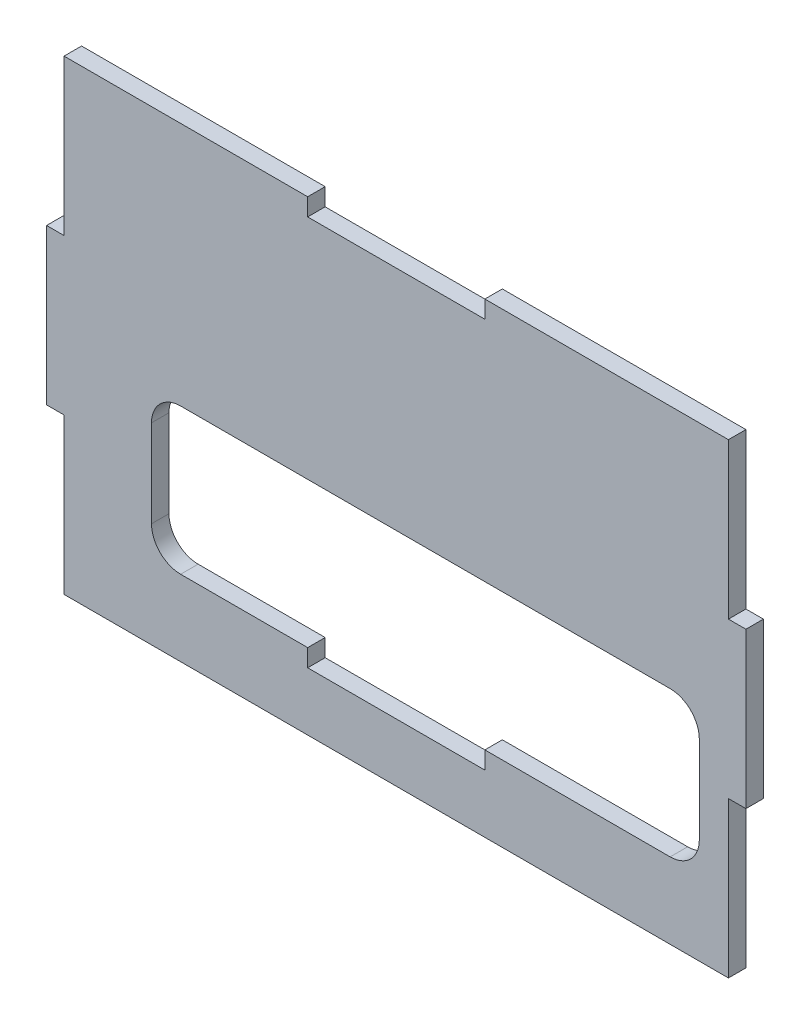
ISO-10303-21;
HEADER;
FILE_DESCRIPTION(('STEP AP214'),'2;1');
FILE_NAME('part.step','',(''),(''),'','','');
FILE_SCHEMA(('AUTOMOTIVE_DESIGN { 1 0 10303 214 1 1 1 1 }'));
ENDSEC;
DATA;
#1=APPLICATION_CONTEXT('core data for automotive mechanical design processes');
#2=APPLICATION_PROTOCOL_DEFINITION('international standard','automotive_design',2000,#1);
#3=PRODUCT_CONTEXT('',#1,'mechanical');
#4=PRODUCT('Part','Part','',(#3));
#5=PRODUCT_RELATED_PRODUCT_CATEGORY('part','',(#4));
#6=PRODUCT_DEFINITION_FORMATION('','',#4);
#7=PRODUCT_DEFINITION_CONTEXT('part definition',#1,'design');
#8=PRODUCT_DEFINITION('design','',#6,#7);
#9=PRODUCT_DEFINITION_SHAPE('','',#8);
#10=(LENGTH_UNIT() NAMED_UNIT(*) SI_UNIT(.MILLI.,.METRE.));
#11=(NAMED_UNIT(*) PLANE_ANGLE_UNIT() SI_UNIT($,.RADIAN.));
#12=(NAMED_UNIT(*) SI_UNIT($,.STERADIAN.) SOLID_ANGLE_UNIT());
#13=UNCERTAINTY_MEASURE_WITH_UNIT(LENGTH_MEASURE(1.E-05),#10,'distance_accuracy_value','');
#14=(GEOMETRIC_REPRESENTATION_CONTEXT(3) GLOBAL_UNCERTAINTY_ASSIGNED_CONTEXT((#13)) GLOBAL_UNIT_ASSIGNED_CONTEXT((#10,
#11,#12)) REPRESENTATION_CONTEXT('',''));
#15=CARTESIAN_POINT('',(0.,0.,0.));
#16=DIRECTION('',(0.,0.,1.));
#17=DIRECTION('',(1.,0.,0.));
#18=AXIS2_PLACEMENT_3D('',#15,#16,#17);
#19=CARTESIAN_POINT('',(0.,0.,3.));
#20=DIRECTION('',(0.,0.,-1.));
#21=DIRECTION('',(-1.,0.,0.));
#22=AXIS2_PLACEMENT_3D('',#19,#20,#21);
#23=PLANE('',#22);
#24=DIRECTION('',(0.,1.,0.));
#25=VECTOR('',#24,1.);
#26=CARTESIAN_POINT('',(52.,-27.,3.));
#27=LINE('',#26,#25);
#28=CARTESIAN_POINT('',(52.,-22.,3.));
#29=VERTEX_POINT('',#28);
#30=CARTESIAN_POINT('',(52.,-7.00000000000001,3.));
#31=VERTEX_POINT('',#30);
#32=EDGE_CURVE('E294',#29,#31,#27,.T.);
#33=ORIENTED_EDGE('',*,*,#32,.F.);
#34=CARTESIAN_POINT('',(47.,-22.,3.));
#35=DIRECTION('',(0.,0.,-1.));
#36=DIRECTION('',(-1.,0.,0.));
#37=AXIS2_PLACEMENT_3D('',#34,#35,#36);
#38=CIRCLE('',#37,5.);
#39=CARTESIAN_POINT('',(47.,-27.,3.));
#40=VERTEX_POINT('',#39);
#41=EDGE_CURVE('E40',#29,#40,#38,.T.);
#42=ORIENTED_EDGE('',*,*,#41,.T.);
#43=DIRECTION('',(1.,0.,0.));
#44=VECTOR('',#43,1.);
#45=CARTESIAN_POINT('',(-42.,-27.,3.));
#46=LINE('',#45,#44);
#47=CARTESIAN_POINT('',(15.2,-27.,3.));
#48=VERTEX_POINT('',#47);
#49=EDGE_CURVE('E291',#48,#40,#46,.T.);
#50=ORIENTED_EDGE('',*,*,#49,.F.);
#51=DIRECTION('',(0.,-1.,0.));
#52=VECTOR('',#51,1.);
#53=CARTESIAN_POINT('',(15.2,0.,3.));
#54=LINE('',#53,#52);
#55=CARTESIAN_POINT('',(15.2,-30.,3.));
#56=VERTEX_POINT('',#55);
#57=EDGE_CURVE('E380',#48,#56,#54,.T.);
#58=ORIENTED_EDGE('',*,*,#57,.T.);
#59=DIRECTION('',(1.,0.,0.));
#60=VECTOR('',#59,1.);
#61=CARTESIAN_POINT('',(0.,-30.,3.));
#62=LINE('',#61,#60);
#63=CARTESIAN_POINT('',(-15.2,-30.,3.));
#64=VERTEX_POINT('',#63);
#65=EDGE_CURVE('E403',#64,#56,#62,.T.);
#66=ORIENTED_EDGE('',*,*,#65,.F.);
#67=DIRECTION('',(0.,-1.,0.));
#68=VECTOR('',#67,1.);
#69=CARTESIAN_POINT('',(-15.2,0.,3.));
#70=LINE('',#69,#68);
#71=CARTESIAN_POINT('',(-15.2,-27.,3.));
#72=VERTEX_POINT('',#71);
#73=EDGE_CURVE('E410',#72,#64,#70,.T.);
#74=ORIENTED_EDGE('',*,*,#73,.F.);
#75=CARTESIAN_POINT('',(-37.,-27.,3.));
#76=VERTEX_POINT('',#75);
#77=EDGE_CURVE('E300',#76,#72,#46,.T.);
#78=ORIENTED_EDGE('',*,*,#77,.F.);
#79=CARTESIAN_POINT('',(-37.,-22.,3.));
#80=DIRECTION('',(0.,0.,-1.));
#81=DIRECTION('',(-1.,0.,0.));
#82=AXIS2_PLACEMENT_3D('',#79,#80,#81);
#83=CIRCLE('',#82,5.);
#84=CARTESIAN_POINT('',(-42.,-22.,3.));
#85=VERTEX_POINT('',#84);
#86=EDGE_CURVE('E275',#76,#85,#83,.T.);
#87=ORIENTED_EDGE('',*,*,#86,.T.);
#88=DIRECTION('',(0.,-1.,0.));
#89=VECTOR('',#88,1.);
#90=CARTESIAN_POINT('',(-42.,-27.,3.));
#91=LINE('',#90,#89);
#92=CARTESIAN_POINT('',(-42.,-7.00000000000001,3.));
#93=VERTEX_POINT('',#92);
#94=EDGE_CURVE('E301',#93,#85,#91,.T.);
#95=ORIENTED_EDGE('',*,*,#94,.F.);
#96=CARTESIAN_POINT('',(-37.,-7.00000000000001,3.));
#97=DIRECTION('',(0.,0.,-1.));
#98=DIRECTION('',(-1.,0.,0.));
#99=AXIS2_PLACEMENT_3D('',#96,#97,#98);
#100=CIRCLE('',#99,5.);
#101=CARTESIAN_POINT('',(-37.,-2.00000000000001,3.));
#102=VERTEX_POINT('',#101);
#103=EDGE_CURVE('E279',#93,#102,#100,.T.);
#104=ORIENTED_EDGE('',*,*,#103,.T.);
#105=DIRECTION('',(-1.,0.,0.));
#106=VECTOR('',#105,1.);
#107=CARTESIAN_POINT('',(-42.,-2.00000000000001,3.));
#108=LINE('',#107,#106);
#109=CARTESIAN_POINT('',(47.,-2.00000000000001,3.));
#110=VERTEX_POINT('',#109);
#111=EDGE_CURVE('E327',#110,#102,#108,.T.);
#112=ORIENTED_EDGE('',*,*,#111,.F.);
#113=CARTESIAN_POINT('',(47.,-7.00000000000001,3.));
#114=DIRECTION('',(0.,0.,-1.));
#115=DIRECTION('',(-1.,0.,0.));
#116=AXIS2_PLACEMENT_3D('',#113,#114,#115);
#117=CIRCLE('',#116,5.);
#118=EDGE_CURVE('E283',#110,#31,#117,.T.);
#119=ORIENTED_EDGE('',*,*,#118,.T.);
#120=EDGE_LOOP('',(#33,#42,#50,#58,#66,#74,#78,#87,#95,#104,#112,#119));
#121=FACE_BOUND('',#120,.T.);
#122=DIRECTION('',(0.,-1.,0.));
#123=VECTOR('',#122,1.);
#124=CARTESIAN_POINT('',(15.2,67.,3.));
#125=LINE('',#124,#123);
#126=CARTESIAN_POINT('',(15.2,40.,3.));
#127=VERTEX_POINT('',#126);
#128=CARTESIAN_POINT('',(15.2,37.,3.));
#129=VERTEX_POINT('',#128);
#130=EDGE_CURVE('E222',#127,#129,#125,.T.);
#131=ORIENTED_EDGE('',*,*,#130,.T.);
#132=DIRECTION('',(1.,0.,0.));
#133=VECTOR('',#132,1.);
#134=CARTESIAN_POINT('',(0.,37.,3.));
#135=LINE('',#134,#133);
#136=CARTESIAN_POINT('',(-15.2,37.,3.));
#137=VERTEX_POINT('',#136);
#138=EDGE_CURVE('E237',#137,#129,#135,.T.);
#139=ORIENTED_EDGE('',*,*,#138,.F.);
#140=DIRECTION('',(0.,-1.,0.));
#141=VECTOR('',#140,1.);
#142=CARTESIAN_POINT('',(-15.2,67.,3.));
#143=LINE('',#142,#141);
#144=CARTESIAN_POINT('',(-15.2,40.,3.));
#145=VERTEX_POINT('',#144);
#146=EDGE_CURVE('E524',#145,#137,#143,.T.);
#147=ORIENTED_EDGE('',*,*,#146,.F.);
#148=DIRECTION('',(-1.,0.,0.));
#149=VECTOR('',#148,1.);
#150=CARTESIAN_POINT('',(-60.,40.,3.));
#151=LINE('',#150,#149);
#152=CARTESIAN_POINT('',(-57.,40.,3.));
#153=VERTEX_POINT('',#152);
#154=EDGE_CURVE('E425',#145,#153,#151,.T.);
#155=ORIENTED_EDGE('',*,*,#154,.T.);
#156=DIRECTION('',(0.,-1.,0.));
#157=VECTOR('',#156,1.);
#158=CARTESIAN_POINT('',(-57.,0.,3.));
#159=LINE('',#158,#157);
#160=CARTESIAN_POINT('',(-57.,13.3333333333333,3.));
#161=VERTEX_POINT('',#160);
#162=EDGE_CURVE('E372',#153,#161,#159,.T.);
#163=ORIENTED_EDGE('',*,*,#162,.T.);
#164=DIRECTION('',(1.,0.,0.));
#165=VECTOR('',#164,1.);
#166=CARTESIAN_POINT('',(0.,13.3333333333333,3.));
#167=LINE('',#166,#165);
#168=CARTESIAN_POINT('',(-60.,13.3333333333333,3.));
#169=VERTEX_POINT('',#168);
#170=EDGE_CURVE('E368',#169,#161,#167,.T.);
#171=ORIENTED_EDGE('',*,*,#170,.F.);
#172=DIRECTION('',(0.,-1.,0.));
#173=VECTOR('',#172,1.);
#174=CARTESIAN_POINT('',(-60.,-40.,3.));
#175=LINE('',#174,#173);
#176=CARTESIAN_POINT('',(-60.,-13.3333333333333,3.));
#177=VERTEX_POINT('',#176);
#178=EDGE_CURVE('E428',#169,#177,#175,.T.);
#179=ORIENTED_EDGE('',*,*,#178,.T.);
#180=DIRECTION('',(1.,0.,0.));
#181=VECTOR('',#180,1.);
#182=CARTESIAN_POINT('',(0.,-13.3333333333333,3.));
#183=LINE('',#182,#181);
#184=CARTESIAN_POINT('',(-57.,-13.3333333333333,3.));
#185=VERTEX_POINT('',#184);
#186=EDGE_CURVE('E388',#177,#185,#183,.T.);
#187=ORIENTED_EDGE('',*,*,#186,.T.);
#188=DIRECTION('',(0.,-1.,0.));
#189=VECTOR('',#188,1.);
#190=CARTESIAN_POINT('',(-57.,0.,3.));
#191=LINE('',#190,#189);
#192=CARTESIAN_POINT('',(-57.,-40.,3.));
#193=VERTEX_POINT('',#192);
#194=EDGE_CURVE('E344',#185,#193,#191,.T.);
#195=ORIENTED_EDGE('',*,*,#194,.T.);
#196=DIRECTION('',(1.,0.,0.));
#197=VECTOR('',#196,1.);
#198=CARTESIAN_POINT('',(-60.,-40.,3.));
#199=LINE('',#198,#197);
#200=CARTESIAN_POINT('',(57.,-40.,3.));
#201=VERTEX_POINT('',#200);
#202=EDGE_CURVE('E259',#193,#201,#199,.T.);
#203=ORIENTED_EDGE('',*,*,#202,.T.);
#204=DIRECTION('',(0.,-1.,0.));
#205=VECTOR('',#204,1.);
#206=CARTESIAN_POINT('',(57.,0.,3.));
#207=LINE('',#206,#205);
#208=CARTESIAN_POINT('',(57.,-13.3333333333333,3.));
#209=VERTEX_POINT('',#208);
#210=EDGE_CURVE('E318',#209,#201,#207,.T.);
#211=ORIENTED_EDGE('',*,*,#210,.F.);
#212=DIRECTION('',(-1.,0.,0.));
#213=VECTOR('',#212,1.);
#214=CARTESIAN_POINT('',(0.,-13.3333333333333,3.));
#215=LINE('',#214,#213);
#216=CARTESIAN_POINT('',(60.,-13.3333333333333,3.));
#217=VERTEX_POINT('',#216);
#218=EDGE_CURVE('E353',#217,#209,#215,.T.);
#219=ORIENTED_EDGE('',*,*,#218,.F.);
#220=DIRECTION('',(0.,1.,0.));
#221=VECTOR('',#220,1.);
#222=CARTESIAN_POINT('',(60.,-40.,3.));
#223=LINE('',#222,#221);
#224=CARTESIAN_POINT('',(60.,13.3333333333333,3.));
#225=VERTEX_POINT('',#224);
#226=EDGE_CURVE('E254',#217,#225,#223,.T.);
#227=ORIENTED_EDGE('',*,*,#226,.T.);
#228=DIRECTION('',(-1.,0.,0.));
#229=VECTOR('',#228,1.);
#230=CARTESIAN_POINT('',(0.,13.3333333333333,3.));
#231=LINE('',#230,#229);
#232=CARTESIAN_POINT('',(57.,13.3333333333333,3.));
#233=VERTEX_POINT('',#232);
#234=EDGE_CURVE('E334',#225,#233,#231,.T.);
#235=ORIENTED_EDGE('',*,*,#234,.T.);
#236=DIRECTION('',(0.,-1.,0.));
#237=VECTOR('',#236,1.);
#238=CARTESIAN_POINT('',(57.,0.,3.));
#239=LINE('',#238,#237);
#240=CARTESIAN_POINT('',(57.,40.,3.));
#241=VERTEX_POINT('',#240);
#242=EDGE_CURVE('E337',#241,#233,#239,.T.);
#243=ORIENTED_EDGE('',*,*,#242,.F.);
#244=EDGE_CURVE('E426',#241,#127,#151,.T.);
#245=ORIENTED_EDGE('',*,*,#244,.T.);
#246=EDGE_LOOP('',(#131,#139,#147,#155,#163,#171,#179,#187,#195,#203,#211,#219,#227,#235,#243,#245));
#247=FACE_BOUND('',#246,.T.);
#248=ADVANCED_FACE('F32',(#121,#247),#23,.F.);
#249=CARTESIAN_POINT('',(0.,0.,0.));
#250=DIRECTION('',(0.,0.,-1.));
#251=DIRECTION('',(-1.,0.,0.));
#252=AXIS2_PLACEMENT_3D('',#249,#250,#251);
#253=PLANE('',#252);
#254=DIRECTION('',(1.,0.,0.));
#255=VECTOR('',#254,1.);
#256=CARTESIAN_POINT('',(-42.,-27.,0.));
#257=LINE('',#256,#255);
#258=CARTESIAN_POINT('',(15.2,-27.,0.));
#259=VERTEX_POINT('',#258);
#260=CARTESIAN_POINT('',(47.,-27.,0.));
#261=VERTEX_POINT('',#260);
#262=EDGE_CURVE('E310',#259,#261,#257,.T.);
#263=ORIENTED_EDGE('',*,*,#262,.T.);
#264=CARTESIAN_POINT('',(47.,-22.,0.));
#265=DIRECTION('',(0.,0.,-1.));
#266=DIRECTION('',(-1.,0.,0.));
#267=AXIS2_PLACEMENT_3D('',#264,#265,#266);
#268=CIRCLE('',#267,5.);
#269=CARTESIAN_POINT('',(52.,-22.,0.));
#270=VERTEX_POINT('',#269);
#271=EDGE_CURVE('E11',#261,#270,#268,.F.);
#272=ORIENTED_EDGE('',*,*,#271,.T.);
#273=DIRECTION('',(0.,1.,0.));
#274=VECTOR('',#273,1.);
#275=CARTESIAN_POINT('',(52.,-27.,0.));
#276=LINE('',#275,#274);
#277=CARTESIAN_POINT('',(52.,-7.00000000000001,0.));
#278=VERTEX_POINT('',#277);
#279=EDGE_CURVE('E307',#270,#278,#276,.T.);
#280=ORIENTED_EDGE('',*,*,#279,.T.);
#281=CARTESIAN_POINT('',(47.,-7.00000000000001,0.));
#282=DIRECTION('',(0.,0.,-1.));
#283=DIRECTION('',(-1.,0.,0.));
#284=AXIS2_PLACEMENT_3D('',#281,#282,#283);
#285=CIRCLE('',#284,5.);
#286=CARTESIAN_POINT('',(47.,-2.00000000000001,0.));
#287=VERTEX_POINT('',#286);
#288=EDGE_CURVE('E285',#278,#287,#285,.F.);
#289=ORIENTED_EDGE('',*,*,#288,.T.);
#290=DIRECTION('',(-1.,0.,0.));
#291=VECTOR('',#290,1.);
#292=CARTESIAN_POINT('',(-42.,-2.00000000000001,0.));
#293=LINE('',#292,#291);
#294=CARTESIAN_POINT('',(-37.,-2.00000000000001,0.));
#295=VERTEX_POINT('',#294);
#296=EDGE_CURVE('E314',#287,#295,#293,.T.);
#297=ORIENTED_EDGE('',*,*,#296,.T.);
#298=CARTESIAN_POINT('',(-37.,-7.00000000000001,0.));
#299=DIRECTION('',(0.,0.,-1.));
#300=DIRECTION('',(-1.,0.,0.));
#301=AXIS2_PLACEMENT_3D('',#298,#299,#300);
#302=CIRCLE('',#301,5.);
#303=CARTESIAN_POINT('',(-42.,-7.00000000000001,0.));
#304=VERTEX_POINT('',#303);
#305=EDGE_CURVE('E281',#295,#304,#302,.F.);
#306=ORIENTED_EDGE('',*,*,#305,.T.);
#307=DIRECTION('',(0.,-1.,0.));
#308=VECTOR('',#307,1.);
#309=CARTESIAN_POINT('',(-42.,-27.,0.));
#310=LINE('',#309,#308);
#311=CARTESIAN_POINT('',(-42.,-22.,0.));
#312=VERTEX_POINT('',#311);
#313=EDGE_CURVE('E330',#304,#312,#310,.T.);
#314=ORIENTED_EDGE('',*,*,#313,.T.);
#315=CARTESIAN_POINT('',(-37.,-22.,0.));
#316=DIRECTION('',(0.,0.,-1.));
#317=DIRECTION('',(-1.,0.,0.));
#318=AXIS2_PLACEMENT_3D('',#315,#316,#317);
#319=CIRCLE('',#318,5.);
#320=CARTESIAN_POINT('',(-37.,-27.,0.));
#321=VERTEX_POINT('',#320);
#322=EDGE_CURVE('E277',#312,#321,#319,.F.);
#323=ORIENTED_EDGE('',*,*,#322,.T.);
#324=CARTESIAN_POINT('',(-15.2,-27.,0.));
#325=VERTEX_POINT('',#324);
#326=EDGE_CURVE('E315',#321,#325,#257,.T.);
#327=ORIENTED_EDGE('',*,*,#326,.T.);
#328=DIRECTION('',(0.,-1.,0.));
#329=VECTOR('',#328,1.);
#330=CARTESIAN_POINT('',(-15.2,0.,0.));
#331=LINE('',#330,#329);
#332=CARTESIAN_POINT('',(-15.2,-30.,0.));
#333=VERTEX_POINT('',#332);
#334=EDGE_CURVE('E402',#325,#333,#331,.T.);
#335=ORIENTED_EDGE('',*,*,#334,.T.);
#336=DIRECTION('',(1.,0.,0.));
#337=VECTOR('',#336,1.);
#338=CARTESIAN_POINT('',(0.,-30.,0.));
#339=LINE('',#338,#337);
#340=CARTESIAN_POINT('',(15.2,-30.,0.));
#341=VERTEX_POINT('',#340);
#342=EDGE_CURVE('E406',#333,#341,#339,.T.);
#343=ORIENTED_EDGE('',*,*,#342,.T.);
#344=DIRECTION('',(0.,-1.,0.));
#345=VECTOR('',#344,1.);
#346=CARTESIAN_POINT('',(15.2,0.,0.));
#347=LINE('',#346,#345);
#348=EDGE_CURVE('E400',#259,#341,#347,.T.);
#349=ORIENTED_EDGE('',*,*,#348,.F.);
#350=EDGE_LOOP('',(#263,#272,#280,#289,#297,#306,#314,#323,#327,#335,#343,#349));
#351=FACE_BOUND('',#350,.T.);
#352=DIRECTION('',(1.,0.,0.));
#353=VECTOR('',#352,1.);
#354=CARTESIAN_POINT('',(0.,37.,0.));
#355=LINE('',#354,#353);
#356=CARTESIAN_POINT('',(-15.2,37.,0.));
#357=VERTEX_POINT('',#356);
#358=CARTESIAN_POINT('',(15.2,37.,0.));
#359=VERTEX_POINT('',#358);
#360=EDGE_CURVE('E228',#357,#359,#355,.T.);
#361=ORIENTED_EDGE('',*,*,#360,.T.);
#362=DIRECTION('',(0.,-1.,0.));
#363=VECTOR('',#362,1.);
#364=CARTESIAN_POINT('',(15.2,67.,0.));
#365=LINE('',#364,#363);
#366=CARTESIAN_POINT('',(15.2,40.,0.));
#367=VERTEX_POINT('',#366);
#368=EDGE_CURVE('E219',#367,#359,#365,.T.);
#369=ORIENTED_EDGE('',*,*,#368,.F.);
#370=DIRECTION('',(-1.,0.,0.));
#371=VECTOR('',#370,1.);
#372=CARTESIAN_POINT('',(-60.,40.,0.));
#373=LINE('',#372,#371);
#374=CARTESIAN_POINT('',(57.,40.,0.));
#375=VERTEX_POINT('',#374);
#376=EDGE_CURVE('E235',#375,#367,#373,.T.);
#377=ORIENTED_EDGE('',*,*,#376,.F.);
#378=DIRECTION('',(0.,-1.,0.));
#379=VECTOR('',#378,1.);
#380=CARTESIAN_POINT('',(57.,0.,0.));
#381=LINE('',#380,#379);
#382=CARTESIAN_POINT('',(57.,13.3333333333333,0.));
#383=VERTEX_POINT('',#382);
#384=EDGE_CURVE('E331',#375,#383,#381,.T.);
#385=ORIENTED_EDGE('',*,*,#384,.T.);
#386=DIRECTION('',(-1.,0.,0.));
#387=VECTOR('',#386,1.);
#388=CARTESIAN_POINT('',(0.,13.3333333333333,0.));
#389=LINE('',#388,#387);
#390=CARTESIAN_POINT('',(60.,13.3333333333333,0.));
#391=VERTEX_POINT('',#390);
#392=EDGE_CURVE('E333',#391,#383,#389,.T.);
#393=ORIENTED_EDGE('',*,*,#392,.F.);
#394=DIRECTION('',(0.,1.,0.));
#395=VECTOR('',#394,1.);
#396=CARTESIAN_POINT('',(60.,-40.,0.));
#397=LINE('',#396,#395);
#398=CARTESIAN_POINT('',(60.,-13.3333333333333,0.));
#399=VERTEX_POINT('',#398);
#400=EDGE_CURVE('E248',#399,#391,#397,.T.);
#401=ORIENTED_EDGE('',*,*,#400,.F.);
#402=DIRECTION('',(-1.,0.,0.));
#403=VECTOR('',#402,1.);
#404=CARTESIAN_POINT('',(0.,-13.3333333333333,0.));
#405=LINE('',#404,#403);
#406=CARTESIAN_POINT('',(57.,-13.3333333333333,0.));
#407=VERTEX_POINT('',#406);
#408=EDGE_CURVE('E352',#399,#407,#405,.T.);
#409=ORIENTED_EDGE('',*,*,#408,.T.);
#410=DIRECTION('',(0.,-1.,0.));
#411=VECTOR('',#410,1.);
#412=CARTESIAN_POINT('',(57.,0.,0.));
#413=LINE('',#412,#411);
#414=CARTESIAN_POINT('',(57.,-40.,0.));
#415=VERTEX_POINT('',#414);
#416=EDGE_CURVE('E349',#407,#415,#413,.T.);
#417=ORIENTED_EDGE('',*,*,#416,.T.);
#418=DIRECTION('',(1.,0.,0.));
#419=VECTOR('',#418,1.);
#420=CARTESIAN_POINT('',(-60.,-40.,0.));
#421=LINE('',#420,#419);
#422=CARTESIAN_POINT('',(-57.,-40.,0.));
#423=VERTEX_POINT('',#422);
#424=EDGE_CURVE('E246',#423,#415,#421,.T.);
#425=ORIENTED_EDGE('',*,*,#424,.F.);
#426=DIRECTION('',(0.,-1.,0.));
#427=VECTOR('',#426,1.);
#428=CARTESIAN_POINT('',(-57.,0.,0.));
#429=LINE('',#428,#427);
#430=CARTESIAN_POINT('',(-57.,-13.3333333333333,0.));
#431=VERTEX_POINT('',#430);
#432=EDGE_CURVE('E385',#431,#423,#429,.T.);
#433=ORIENTED_EDGE('',*,*,#432,.F.);
#434=DIRECTION('',(1.,0.,0.));
#435=VECTOR('',#434,1.);
#436=CARTESIAN_POINT('',(0.,-13.3333333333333,0.));
#437=LINE('',#436,#435);
#438=CARTESIAN_POINT('',(-60.,-13.3333333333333,0.));
#439=VERTEX_POINT('',#438);
#440=EDGE_CURVE('E387',#439,#431,#437,.T.);
#441=ORIENTED_EDGE('',*,*,#440,.F.);
#442=DIRECTION('',(0.,-1.,0.));
#443=VECTOR('',#442,1.);
#444=CARTESIAN_POINT('',(-60.,-40.,0.));
#445=LINE('',#444,#443);
#446=CARTESIAN_POINT('',(-60.,13.3333333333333,0.));
#447=VERTEX_POINT('',#446);
#448=EDGE_CURVE('E242',#447,#439,#445,.T.);
#449=ORIENTED_EDGE('',*,*,#448,.F.);
#450=DIRECTION('',(1.,0.,0.));
#451=VECTOR('',#450,1.);
#452=CARTESIAN_POINT('',(0.,13.3333333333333,0.));
#453=LINE('',#452,#451);
#454=CARTESIAN_POINT('',(-57.,13.3333333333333,0.));
#455=VERTEX_POINT('',#454);
#456=EDGE_CURVE('E367',#447,#455,#453,.T.);
#457=ORIENTED_EDGE('',*,*,#456,.T.);
#458=DIRECTION('',(0.,-1.,0.));
#459=VECTOR('',#458,1.);
#460=CARTESIAN_POINT('',(-57.,0.,0.));
#461=LINE('',#460,#459);
#462=CARTESIAN_POINT('',(-57.,40.,0.));
#463=VERTEX_POINT('',#462);
#464=EDGE_CURVE('E365',#463,#455,#461,.T.);
#465=ORIENTED_EDGE('',*,*,#464,.F.);
#466=CARTESIAN_POINT('',(-15.2,40.,0.));
#467=VERTEX_POINT('',#466);
#468=EDGE_CURVE('E243',#467,#463,#373,.T.);
#469=ORIENTED_EDGE('',*,*,#468,.F.);
#470=DIRECTION('',(0.,-1.,0.));
#471=VECTOR('',#470,1.);
#472=CARTESIAN_POINT('',(-15.2,67.,0.));
#473=LINE('',#472,#471);
#474=EDGE_CURVE('E47',#467,#357,#473,.T.);
#475=ORIENTED_EDGE('',*,*,#474,.T.);
#476=EDGE_LOOP('',(#361,#369,#377,#385,#393,#401,#409,#417,#425,#433,#441,#449,#457,#465,#469,#475));
#477=FACE_BOUND('',#476,.T.);
#478=ADVANCED_FACE('F233',(#351,#477),#253,.T.);
#479=CARTESIAN_POINT('',(-60.,40.,3.));
#480=DIRECTION('',(0.,-1.,0.));
#481=DIRECTION('',(0.,0.,-1.));
#482=AXIS2_PLACEMENT_3D('',#479,#480,#481);
#483=PLANE('',#482);
#484=DIRECTION('',(0.,0.,1.));
#485=VECTOR('',#484,1.);
#486=CARTESIAN_POINT('',(15.2,40.,0.));
#487=LINE('',#486,#485);
#488=EDGE_CURVE('E216',#367,#127,#487,.T.);
#489=ORIENTED_EDGE('',*,*,#488,.T.);
#490=ORIENTED_EDGE('',*,*,#244,.F.);
#491=DIRECTION('',(0.,0.,1.));
#492=VECTOR('',#491,1.);
#493=CARTESIAN_POINT('',(57.,40.,0.));
#494=LINE('',#493,#492);
#495=EDGE_CURVE('E241',#375,#241,#494,.T.);
#496=ORIENTED_EDGE('',*,*,#495,.F.);
#497=ORIENTED_EDGE('',*,*,#376,.T.);
#498=EDGE_LOOP('',(#489,#490,#496,#497));
#499=FACE_BOUND('',#498,.T.);
#500=ADVANCED_FACE('F240',(#499),#483,.F.);
#501=CARTESIAN_POINT('',(60.,-40.,3.));
#502=DIRECTION('',(-1.,0.,0.));
#503=DIRECTION('',(0.,0.,1.));
#504=AXIS2_PLACEMENT_3D('',#501,#502,#503);
#505=PLANE('',#504);
#506=DIRECTION('',(0.,0.,1.));
#507=VECTOR('',#506,1.);
#508=CARTESIAN_POINT('',(60.,13.3333333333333,0.));
#509=LINE('',#508,#507);
#510=EDGE_CURVE('E345',#391,#225,#509,.T.);
#511=ORIENTED_EDGE('',*,*,#510,.T.);
#512=ORIENTED_EDGE('',*,*,#226,.F.);
#513=DIRECTION('',(0.,0.,1.));
#514=VECTOR('',#513,1.);
#515=CARTESIAN_POINT('',(60.,-13.3333333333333,0.));
#516=LINE('',#515,#514);
#517=EDGE_CURVE('E361',#399,#217,#516,.T.);
#518=ORIENTED_EDGE('',*,*,#517,.F.);
#519=ORIENTED_EDGE('',*,*,#400,.T.);
#520=EDGE_LOOP('',(#511,#512,#518,#519));
#521=FACE_BOUND('',#520,.T.);
#522=ADVANCED_FACE('F451',(#521),#505,.F.);
#523=ORIENTED_EDGE('',*,*,#154,.F.);
#524=DIRECTION('',(0.,0.,1.));
#525=VECTOR('',#524,1.);
#526=CARTESIAN_POINT('',(-15.2,40.,0.));
#527=LINE('',#526,#525);
#528=EDGE_CURVE('E227',#467,#145,#527,.T.);
#529=ORIENTED_EDGE('',*,*,#528,.F.);
#530=ORIENTED_EDGE('',*,*,#468,.T.);
#531=DIRECTION('',(0.,0.,1.));
#532=VECTOR('',#531,1.);
#533=CARTESIAN_POINT('',(-57.,40.,0.));
#534=LINE('',#533,#532);
#535=EDGE_CURVE('E371',#463,#153,#534,.T.);
#536=ORIENTED_EDGE('',*,*,#535,.T.);
#537=EDGE_LOOP('',(#523,#529,#530,#536));
#538=FACE_BOUND('',#537,.T.);
#539=ADVANCED_FACE('F482',(#538),#483,.F.);
#540=CARTESIAN_POINT('',(-60.,-40.,3.));
#541=DIRECTION('',(1.,0.,0.));
#542=DIRECTION('',(0.,0.,-1.));
#543=AXIS2_PLACEMENT_3D('',#540,#541,#542);
#544=PLANE('',#543);
#545=ORIENTED_EDGE('',*,*,#178,.F.);
#546=DIRECTION('',(0.,0.,1.));
#547=VECTOR('',#546,1.);
#548=CARTESIAN_POINT('',(-60.,13.3333333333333,0.));
#549=LINE('',#548,#547);
#550=EDGE_CURVE('E381',#447,#169,#549,.T.);
#551=ORIENTED_EDGE('',*,*,#550,.F.);
#552=ORIENTED_EDGE('',*,*,#448,.T.);
#553=DIRECTION('',(0.,0.,1.));
#554=VECTOR('',#553,1.);
#555=CARTESIAN_POINT('',(-60.,-13.3333333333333,0.));
#556=LINE('',#555,#554);
#557=EDGE_CURVE('E396',#439,#177,#556,.T.);
#558=ORIENTED_EDGE('',*,*,#557,.T.);
#559=EDGE_LOOP('',(#545,#551,#552,#558));
#560=FACE_BOUND('',#559,.T.);
#561=ADVANCED_FACE('F479',(#560),#544,.F.);
#562=CARTESIAN_POINT('',(-60.,-40.,3.));
#563=DIRECTION('',(0.,1.,0.));
#564=DIRECTION('',(0.,0.,1.));
#565=AXIS2_PLACEMENT_3D('',#562,#563,#564);
#566=PLANE('',#565);
#567=ORIENTED_EDGE('',*,*,#424,.T.);
#568=DIRECTION('',(0.,0.,1.));
#569=VECTOR('',#568,1.);
#570=CARTESIAN_POINT('',(57.,-40.,0.));
#571=LINE('',#570,#569);
#572=EDGE_CURVE('E356',#415,#201,#571,.T.);
#573=ORIENTED_EDGE('',*,*,#572,.T.);
#574=ORIENTED_EDGE('',*,*,#202,.F.);
#575=DIRECTION('',(0.,0.,1.));
#576=VECTOR('',#575,1.);
#577=CARTESIAN_POINT('',(-57.,-40.,0.));
#578=LINE('',#577,#576);
#579=EDGE_CURVE('E375',#423,#193,#578,.T.);
#580=ORIENTED_EDGE('',*,*,#579,.F.);
#581=EDGE_LOOP('',(#567,#573,#574,#580));
#582=FACE_BOUND('',#581,.T.);
#583=ADVANCED_FACE('F437',(#582),#566,.F.);
#584=CARTESIAN_POINT('',(15.2,0.,0.));
#585=DIRECTION('',(-1.,0.,0.));
#586=DIRECTION('',(0.,-1.,0.));
#587=AXIS2_PLACEMENT_3D('',#584,#585,#586);
#588=PLANE('',#587);
#589=ORIENTED_EDGE('',*,*,#57,.F.);
#590=DIRECTION('',(0.,0.,1.));
#591=VECTOR('',#590,1.);
#592=CARTESIAN_POINT('',(15.2,-27.,0.));
#593=LINE('',#592,#591);
#594=EDGE_CURVE('E299',#259,#48,#593,.T.);
#595=ORIENTED_EDGE('',*,*,#594,.F.);
#596=ORIENTED_EDGE('',*,*,#348,.T.);
#597=DIRECTION('',(0.,0.,1.));
#598=VECTOR('',#597,1.);
#599=CARTESIAN_POINT('',(15.2,-30.,0.));
#600=LINE('',#599,#598);
#601=EDGE_CURVE('E415',#341,#56,#600,.T.);
#602=ORIENTED_EDGE('',*,*,#601,.T.);
#603=EDGE_LOOP('',(#589,#595,#596,#602));
#604=FACE_BOUND('',#603,.T.);
#605=ADVANCED_FACE('F474',(#604),#588,.T.);
#606=CARTESIAN_POINT('',(0.,-30.,0.));
#607=DIRECTION('',(0.,-1.,0.));
#608=DIRECTION('',(1.,0.,0.));
#609=AXIS2_PLACEMENT_3D('',#606,#607,#608);
#610=PLANE('',#609);
#611=ORIENTED_EDGE('',*,*,#65,.T.);
#612=ORIENTED_EDGE('',*,*,#601,.F.);
#613=ORIENTED_EDGE('',*,*,#342,.F.);
#614=DIRECTION('',(0.,0.,1.));
#615=VECTOR('',#614,1.);
#616=CARTESIAN_POINT('',(-15.2,-30.,0.));
#617=LINE('',#616,#615);
#618=EDGE_CURVE('E417',#333,#64,#617,.T.);
#619=ORIENTED_EDGE('',*,*,#618,.T.);
#620=EDGE_LOOP('',(#611,#612,#613,#619));
#621=FACE_BOUND('',#620,.T.);
#622=ADVANCED_FACE('F578',(#621),#610,.F.);
#623=CARTESIAN_POINT('',(-15.2,0.,0.));
#624=DIRECTION('',(-1.,0.,0.));
#625=DIRECTION('',(0.,-1.,0.));
#626=AXIS2_PLACEMENT_3D('',#623,#624,#625);
#627=PLANE('',#626);
#628=ORIENTED_EDGE('',*,*,#73,.T.);
#629=ORIENTED_EDGE('',*,*,#618,.F.);
#630=ORIENTED_EDGE('',*,*,#334,.F.);
#631=DIRECTION('',(0.,0.,1.));
#632=VECTOR('',#631,1.);
#633=CARTESIAN_POINT('',(-15.2,-27.,0.));
#634=LINE('',#633,#632);
#635=EDGE_CURVE('E419',#325,#72,#634,.T.);
#636=ORIENTED_EDGE('',*,*,#635,.T.);
#637=EDGE_LOOP('',(#628,#629,#630,#636));
#638=FACE_BOUND('',#637,.T.);
#639=ADVANCED_FACE('F574',(#638),#627,.F.);
#640=CARTESIAN_POINT('',(-57.,0.,0.));
#641=DIRECTION('',(-1.,0.,0.));
#642=DIRECTION('',(0.,0.,1.));
#643=AXIS2_PLACEMENT_3D('',#640,#641,#642);
#644=PLANE('',#643);
#645=ORIENTED_EDGE('',*,*,#194,.F.);
#646=DIRECTION('',(0.,0.,1.));
#647=VECTOR('',#646,1.);
#648=CARTESIAN_POINT('',(-57.,-13.3333333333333,0.));
#649=LINE('',#648,#647);
#650=EDGE_CURVE('E390',#431,#185,#649,.T.);
#651=ORIENTED_EDGE('',*,*,#650,.F.);
#652=ORIENTED_EDGE('',*,*,#432,.T.);
#653=ORIENTED_EDGE('',*,*,#579,.T.);
#654=EDGE_LOOP('',(#645,#651,#652,#653));
#655=FACE_BOUND('',#654,.T.);
#656=ADVANCED_FACE('F588',(#655),#644,.T.);
#657=CARTESIAN_POINT('',(0.,-13.3333333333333,0.));
#658=DIRECTION('',(0.,-1.,0.));
#659=DIRECTION('',(0.,0.,-1.));
#660=AXIS2_PLACEMENT_3D('',#657,#658,#659);
#661=PLANE('',#660);
#662=ORIENTED_EDGE('',*,*,#186,.F.);
#663=ORIENTED_EDGE('',*,*,#557,.F.);
#664=ORIENTED_EDGE('',*,*,#440,.T.);
#665=ORIENTED_EDGE('',*,*,#650,.T.);
#666=EDGE_LOOP('',(#662,#663,#664,#665));
#667=FACE_BOUND('',#666,.T.);
#668=ADVANCED_FACE('F592',(#667),#661,.T.);
#669=CARTESIAN_POINT('',(-57.,0.,0.));
#670=DIRECTION('',(-1.,0.,0.));
#671=DIRECTION('',(0.,0.,1.));
#672=AXIS2_PLACEMENT_3D('',#669,#670,#671);
#673=PLANE('',#672);
#674=ORIENTED_EDGE('',*,*,#162,.F.);
#675=ORIENTED_EDGE('',*,*,#535,.F.);
#676=ORIENTED_EDGE('',*,*,#464,.T.);
#677=DIRECTION('',(0.,0.,1.));
#678=VECTOR('',#677,1.);
#679=CARTESIAN_POINT('',(-57.,13.3333333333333,0.));
#680=LINE('',#679,#678);
#681=EDGE_CURVE('E378',#455,#161,#680,.T.);
#682=ORIENTED_EDGE('',*,*,#681,.T.);
#683=EDGE_LOOP('',(#674,#675,#676,#682));
#684=FACE_BOUND('',#683,.T.);
#685=ADVANCED_FACE('F535',(#684),#673,.T.);
#686=CARTESIAN_POINT('',(0.,13.3333333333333,0.));
#687=DIRECTION('',(0.,-1.,0.));
#688=DIRECTION('',(0.,0.,-1.));
#689=AXIS2_PLACEMENT_3D('',#686,#687,#688);
#690=PLANE('',#689);
#691=ORIENTED_EDGE('',*,*,#170,.T.);
#692=ORIENTED_EDGE('',*,*,#681,.F.);
#693=ORIENTED_EDGE('',*,*,#456,.F.);
#694=ORIENTED_EDGE('',*,*,#550,.T.);
#695=EDGE_LOOP('',(#691,#692,#693,#694));
#696=FACE_BOUND('',#695,.T.);
#697=ADVANCED_FACE('F599',(#696),#690,.F.);
#698=CARTESIAN_POINT('',(57.,0.,0.));
#699=DIRECTION('',(-1.,0.,0.));
#700=DIRECTION('',(0.,0.,1.));
#701=AXIS2_PLACEMENT_3D('',#698,#699,#700);
#702=PLANE('',#701);
#703=ORIENTED_EDGE('',*,*,#210,.T.);
#704=ORIENTED_EDGE('',*,*,#572,.F.);
#705=ORIENTED_EDGE('',*,*,#416,.F.);
#706=DIRECTION('',(0.,0.,1.));
#707=VECTOR('',#706,1.);
#708=CARTESIAN_POINT('',(57.,-13.3333333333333,0.));
#709=LINE('',#708,#707);
#710=EDGE_CURVE('E340',#407,#209,#709,.T.);
#711=ORIENTED_EDGE('',*,*,#710,.T.);
#712=EDGE_LOOP('',(#703,#704,#705,#711));
#713=FACE_BOUND('',#712,.T.);
#714=ADVANCED_FACE('F441',(#713),#702,.F.);
#715=CARTESIAN_POINT('',(0.,-13.3333333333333,0.));
#716=DIRECTION('',(0.,1.,0.));
#717=DIRECTION('',(0.,0.,1.));
#718=AXIS2_PLACEMENT_3D('',#715,#716,#717);
#719=PLANE('',#718);
#720=ORIENTED_EDGE('',*,*,#218,.T.);
#721=ORIENTED_EDGE('',*,*,#710,.F.);
#722=ORIENTED_EDGE('',*,*,#408,.F.);
#723=ORIENTED_EDGE('',*,*,#517,.T.);
#724=EDGE_LOOP('',(#720,#721,#722,#723));
#725=FACE_BOUND('',#724,.T.);
#726=ADVANCED_FACE('F448',(#725),#719,.F.);
#727=CARTESIAN_POINT('',(57.,0.,0.));
#728=DIRECTION('',(-1.,0.,0.));
#729=DIRECTION('',(0.,0.,1.));
#730=AXIS2_PLACEMENT_3D('',#727,#728,#729);
#731=PLANE('',#730);
#732=ORIENTED_EDGE('',*,*,#242,.T.);
#733=DIRECTION('',(0.,0.,1.));
#734=VECTOR('',#733,1.);
#735=CARTESIAN_POINT('',(57.,13.3333333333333,0.));
#736=LINE('',#735,#734);
#737=EDGE_CURVE('E336',#383,#233,#736,.T.);
#738=ORIENTED_EDGE('',*,*,#737,.F.);
#739=ORIENTED_EDGE('',*,*,#384,.F.);
#740=ORIENTED_EDGE('',*,*,#495,.T.);
#741=EDGE_LOOP('',(#732,#738,#739,#740));
#742=FACE_BOUND('',#741,.T.);
#743=ADVANCED_FACE('F457',(#742),#731,.F.);
#744=CARTESIAN_POINT('',(0.,13.3333333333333,0.));
#745=DIRECTION('',(0.,1.,0.));
#746=DIRECTION('',(0.,0.,1.));
#747=AXIS2_PLACEMENT_3D('',#744,#745,#746);
#748=PLANE('',#747);
#749=ORIENTED_EDGE('',*,*,#234,.F.);
#750=ORIENTED_EDGE('',*,*,#510,.F.);
#751=ORIENTED_EDGE('',*,*,#392,.T.);
#752=ORIENTED_EDGE('',*,*,#737,.T.);
#753=EDGE_LOOP('',(#749,#750,#751,#752));
#754=FACE_BOUND('',#753,.T.);
#755=ADVANCED_FACE('F454',(#754),#748,.T.);
#756=CARTESIAN_POINT('',(-42.,-27.,0.));
#757=DIRECTION('',(0.,-1.,0.));
#758=DIRECTION('',(0.,0.,-1.));
#759=AXIS2_PLACEMENT_3D('',#756,#757,#758);
#760=PLANE('',#759);
#761=ORIENTED_EDGE('',*,*,#326,.F.);
#762=DIRECTION('',(0.,0.,1.));
#763=VECTOR('',#762,1.);
#764=CARTESIAN_POINT('',(-37.,-27.,3.));
#765=LINE('',#764,#763);
#766=EDGE_CURVE('E255',#321,#76,#765,.T.);
#767=ORIENTED_EDGE('',*,*,#766,.T.);
#768=ORIENTED_EDGE('',*,*,#77,.T.);
#769=ORIENTED_EDGE('',*,*,#635,.F.);
#770=EDGE_LOOP('',(#761,#767,#768,#769));
#771=FACE_BOUND('',#770,.T.);
#772=ADVANCED_FACE('F464',(#771),#760,.F.);
#773=CARTESIAN_POINT('',(-42.,-27.,0.));
#774=DIRECTION('',(-1.,0.,0.));
#775=DIRECTION('',(0.,0.,1.));
#776=AXIS2_PLACEMENT_3D('',#773,#774,#775);
#777=PLANE('',#776);
#778=ORIENTED_EDGE('',*,*,#94,.T.);
#779=DIRECTION('',(0.,0.,1.));
#780=VECTOR('',#779,1.);
#781=CARTESIAN_POINT('',(-42.,-22.,0.));
#782=LINE('',#781,#780);
#783=EDGE_CURVE('E262',#85,#312,#782,.F.);
#784=ORIENTED_EDGE('',*,*,#783,.T.);
#785=ORIENTED_EDGE('',*,*,#313,.F.);
#786=DIRECTION('',(0.,0.,1.));
#787=VECTOR('',#786,1.);
#788=CARTESIAN_POINT('',(-42.,-7.00000000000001,3.));
#789=LINE('',#788,#787);
#790=EDGE_CURVE('E258',#304,#93,#789,.T.);
#791=ORIENTED_EDGE('',*,*,#790,.T.);
#792=EDGE_LOOP('',(#778,#784,#785,#791));
#793=FACE_BOUND('',#792,.T.);
#794=ADVANCED_FACE('F514',(#793),#777,.F.);
#795=CARTESIAN_POINT('',(-42.,-2.00000000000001,0.));
#796=DIRECTION('',(0.,1.,0.));
#797=DIRECTION('',(0.,0.,1.));
#798=AXIS2_PLACEMENT_3D('',#795,#796,#797);
#799=PLANE('',#798);
#800=ORIENTED_EDGE('',*,*,#111,.T.);
#801=DIRECTION('',(0.,0.,1.));
#802=VECTOR('',#801,1.);
#803=CARTESIAN_POINT('',(-37.,-2.00000000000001,0.));
#804=LINE('',#803,#802);
#805=EDGE_CURVE('E267',#102,#295,#804,.F.);
#806=ORIENTED_EDGE('',*,*,#805,.T.);
#807=ORIENTED_EDGE('',*,*,#296,.F.);
#808=DIRECTION('',(0.,0.,1.));
#809=VECTOR('',#808,1.);
#810=CARTESIAN_POINT('',(47.,-2.00000000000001,3.));
#811=LINE('',#810,#809);
#812=EDGE_CURVE('E264',#287,#110,#811,.T.);
#813=ORIENTED_EDGE('',*,*,#812,.T.);
#814=EDGE_LOOP('',(#800,#806,#807,#813));
#815=FACE_BOUND('',#814,.T.);
#816=ADVANCED_FACE('F506',(#815),#799,.F.);
#817=CARTESIAN_POINT('',(52.,-27.,0.));
#818=DIRECTION('',(1.,0.,0.));
#819=DIRECTION('',(0.,0.,-1.));
#820=AXIS2_PLACEMENT_3D('',#817,#818,#819);
#821=PLANE('',#820);
#822=ORIENTED_EDGE('',*,*,#32,.T.);
#823=DIRECTION('',(0.,0.,1.));
#824=VECTOR('',#823,1.);
#825=CARTESIAN_POINT('',(52.,-7.00000000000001,0.));
#826=LINE('',#825,#824);
#827=EDGE_CURVE('E272',#31,#278,#826,.F.);
#828=ORIENTED_EDGE('',*,*,#827,.T.);
#829=ORIENTED_EDGE('',*,*,#279,.F.);
#830=DIRECTION('',(0.,0.,1.));
#831=VECTOR('',#830,1.);
#832=CARTESIAN_POINT('',(52.,-22.,3.));
#833=LINE('',#832,#831);
#834=EDGE_CURVE('E269',#270,#29,#833,.T.);
#835=ORIENTED_EDGE('',*,*,#834,.T.);
#836=EDGE_LOOP('',(#822,#828,#829,#835));
#837=FACE_BOUND('',#836,.T.);
#838=ADVANCED_FACE('F312',(#837),#821,.F.);
#839=ORIENTED_EDGE('',*,*,#49,.T.);
#840=DIRECTION('',(0.,0.,1.));
#841=VECTOR('',#840,1.);
#842=CARTESIAN_POINT('',(47.,-27.,0.));
#843=LINE('',#842,#841);
#844=EDGE_CURVE('E55',#40,#261,#843,.F.);
#845=ORIENTED_EDGE('',*,*,#844,.T.);
#846=ORIENTED_EDGE('',*,*,#262,.F.);
#847=ORIENTED_EDGE('',*,*,#594,.T.);
#848=EDGE_LOOP('',(#839,#845,#846,#847));
#849=FACE_BOUND('',#848,.T.);
#850=ADVANCED_FACE('F297',(#849),#760,.F.);
#851=CARTESIAN_POINT('',(-37.,-22.,0.));
#852=DIRECTION('',(0.,0.,-1.));
#853=DIRECTION('',(-1.,0.,0.));
#854=AXIS2_PLACEMENT_3D('',#851,#852,#853);
#855=CYLINDRICAL_SURFACE('',#854,5.);
#856=ORIENTED_EDGE('',*,*,#322,.F.);
#857=ORIENTED_EDGE('',*,*,#783,.F.);
#858=ORIENTED_EDGE('',*,*,#86,.F.);
#859=ORIENTED_EDGE('',*,*,#766,.F.);
#860=EDGE_LOOP('',(#856,#857,#858,#859));
#861=FACE_BOUND('',#860,.T.);
#862=ADVANCED_FACE('F489',(#861),#855,.F.);
#863=CARTESIAN_POINT('',(-37.,-7.00000000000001,0.));
#864=DIRECTION('',(0.,0.,-1.));
#865=DIRECTION('',(-1.,0.,0.));
#866=AXIS2_PLACEMENT_3D('',#863,#864,#865);
#867=CYLINDRICAL_SURFACE('',#866,5.);
#868=ORIENTED_EDGE('',*,*,#305,.F.);
#869=ORIENTED_EDGE('',*,*,#805,.F.);
#870=ORIENTED_EDGE('',*,*,#103,.F.);
#871=ORIENTED_EDGE('',*,*,#790,.F.);
#872=EDGE_LOOP('',(#868,#869,#870,#871));
#873=FACE_BOUND('',#872,.T.);
#874=ADVANCED_FACE('F492',(#873),#867,.F.);
#875=CARTESIAN_POINT('',(47.,-7.00000000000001,0.));
#876=DIRECTION('',(0.,0.,-1.));
#877=DIRECTION('',(-1.,0.,0.));
#878=AXIS2_PLACEMENT_3D('',#875,#876,#877);
#879=CYLINDRICAL_SURFACE('',#878,5.);
#880=ORIENTED_EDGE('',*,*,#288,.F.);
#881=ORIENTED_EDGE('',*,*,#827,.F.);
#882=ORIENTED_EDGE('',*,*,#118,.F.);
#883=ORIENTED_EDGE('',*,*,#812,.F.);
#884=EDGE_LOOP('',(#880,#881,#882,#883));
#885=FACE_BOUND('',#884,.T.);
#886=ADVANCED_FACE('F495',(#885),#879,.F.);
#887=CARTESIAN_POINT('',(47.,-22.,0.));
#888=DIRECTION('',(0.,0.,-1.));
#889=DIRECTION('',(-1.,0.,0.));
#890=AXIS2_PLACEMENT_3D('',#887,#888,#889);
#891=CYLINDRICAL_SURFACE('',#890,5.);
#892=ORIENTED_EDGE('',*,*,#271,.F.);
#893=ORIENTED_EDGE('',*,*,#844,.F.);
#894=ORIENTED_EDGE('',*,*,#41,.F.);
#895=ORIENTED_EDGE('',*,*,#834,.F.);
#896=EDGE_LOOP('',(#892,#893,#894,#895));
#897=FACE_BOUND('',#896,.T.);
#898=ADVANCED_FACE('F34',(#897),#891,.F.);
#899=CARTESIAN_POINT('',(15.2,67.,0.));
#900=DIRECTION('',(-1.,0.,0.));
#901=DIRECTION('',(0.,-1.,0.));
#902=AXIS2_PLACEMENT_3D('',#899,#900,#901);
#903=PLANE('',#902);
#904=ORIENTED_EDGE('',*,*,#130,.F.);
#905=ORIENTED_EDGE('',*,*,#488,.F.);
#906=ORIENTED_EDGE('',*,*,#368,.T.);
#907=DIRECTION('',(0.,0.,1.));
#908=VECTOR('',#907,1.);
#909=CARTESIAN_POINT('',(15.2,37.,0.));
#910=LINE('',#909,#908);
#911=EDGE_CURVE('E324',#359,#129,#910,.T.);
#912=ORIENTED_EDGE('',*,*,#911,.T.);
#913=EDGE_LOOP('',(#904,#905,#906,#912));
#914=FACE_BOUND('',#913,.T.);
#915=ADVANCED_FACE('F218',(#914),#903,.T.);
#916=CARTESIAN_POINT('',(0.,37.,0.));
#917=DIRECTION('',(0.,-1.,0.));
#918=DIRECTION('',(1.,0.,0.));
#919=AXIS2_PLACEMENT_3D('',#916,#917,#918);
#920=PLANE('',#919);
#921=ORIENTED_EDGE('',*,*,#138,.T.);
#922=ORIENTED_EDGE('',*,*,#911,.F.);
#923=ORIENTED_EDGE('',*,*,#360,.F.);
#924=DIRECTION('',(0.,0.,1.));
#925=VECTOR('',#924,1.);
#926=CARTESIAN_POINT('',(-15.2,37.,0.));
#927=LINE('',#926,#925);
#928=EDGE_CURVE('E519',#357,#137,#927,.T.);
#929=ORIENTED_EDGE('',*,*,#928,.T.);
#930=EDGE_LOOP('',(#921,#922,#923,#929));
#931=FACE_BOUND('',#930,.T.);
#932=ADVANCED_FACE('F543',(#931),#920,.F.);
#933=CARTESIAN_POINT('',(-15.2,67.,0.));
#934=DIRECTION('',(-1.,0.,0.));
#935=DIRECTION('',(0.,-1.,0.));
#936=AXIS2_PLACEMENT_3D('',#933,#934,#935);
#937=PLANE('',#936);
#938=ORIENTED_EDGE('',*,*,#146,.T.);
#939=ORIENTED_EDGE('',*,*,#928,.F.);
#940=ORIENTED_EDGE('',*,*,#474,.F.);
#941=ORIENTED_EDGE('',*,*,#528,.T.);
#942=EDGE_LOOP('',(#938,#939,#940,#941));
#943=FACE_BOUND('',#942,.T.);
#944=ADVANCED_FACE('F541',(#943),#937,.F.);
#945=CLOSED_SHELL('',(#248,#478,#500,#522,#539,#561,#583,#605,#622,#639,#656,#668,#685,#697,
#714,#726,#743,#755,#772,#794,#816,#838,#850,#862,#874,#886,#898,#915,#932,#944));
#946=MANIFOLD_SOLID_BREP('B2',#945);
#947=ADVANCED_BREP_SHAPE_REPRESENTATION('',(#18,#946),#14);
#948=SHAPE_DEFINITION_REPRESENTATION(#9,#947);
ENDSEC;
END-ISO-10303-21;
